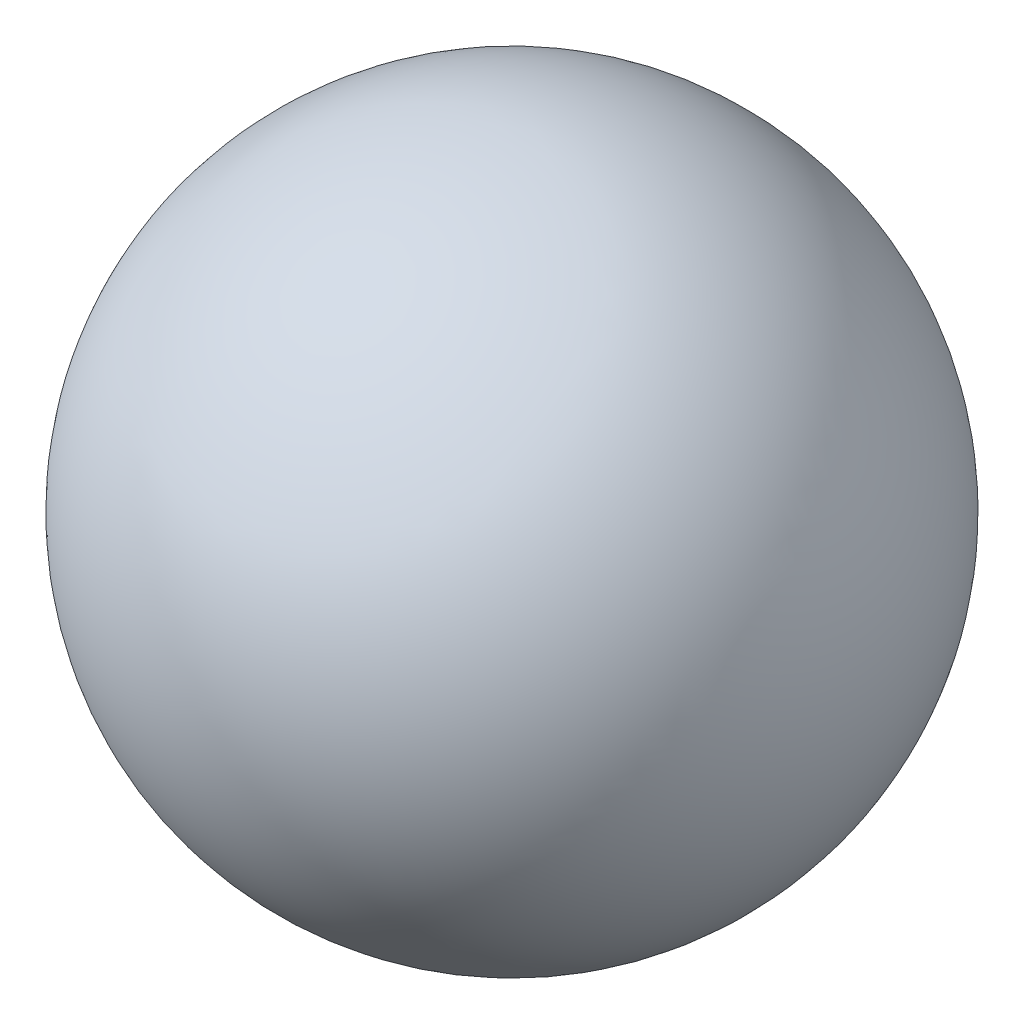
from build123d import *


with BuildPart() as part:
    # Esquisse2 → R_volution1 (revolve)
    with BuildSketch(Plane.XY):
        with BuildLine():
            Line((2, 0), (-2, 0))
            ThreePointArc((-2, 0), (0, 2), (2, 0))
        make_face()
    revolve(axis=Axis((-4.5, 0, 0), (1, 0, 0)))


solid = part.part
